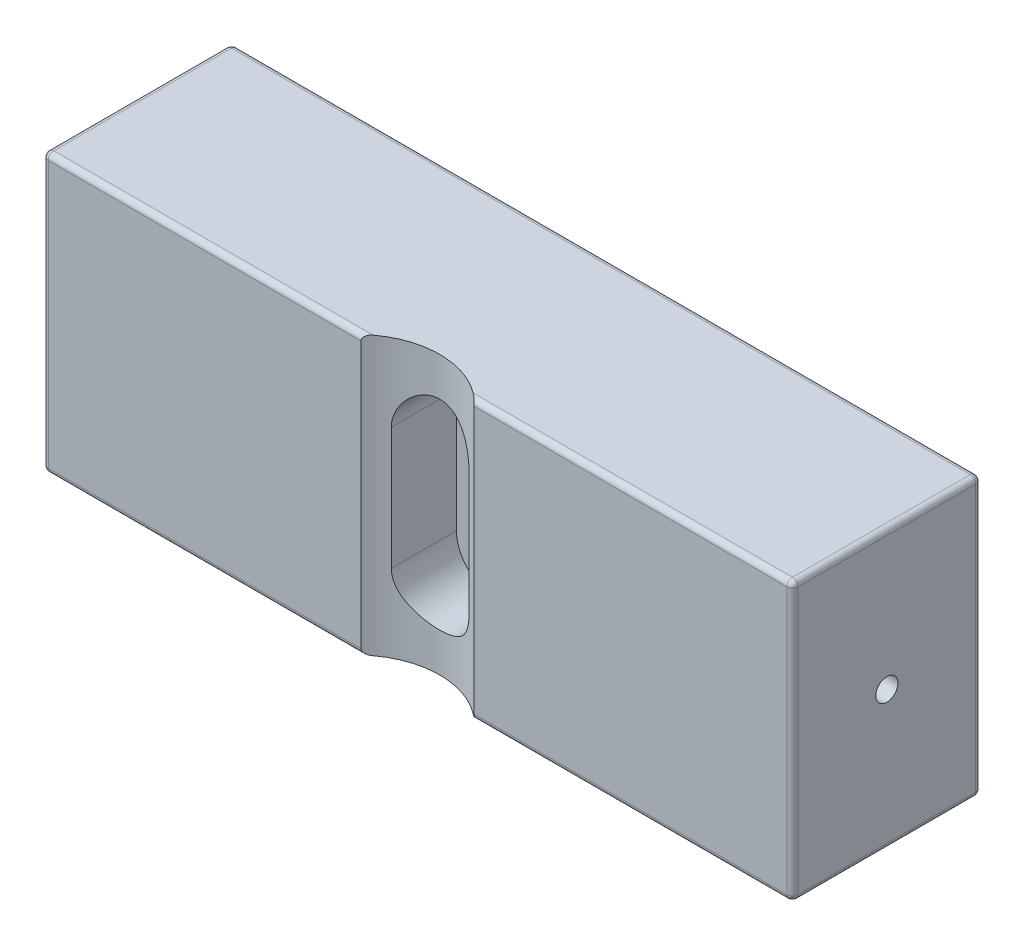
from build123d import *

# Parameters (mm, degrees)
CROQUIS1_W              = 135
CROQUIS1_H              = 50
SALIENTE_EXTRUIR1_DEPTH = 34
CROQUIS2_R              = 15
CORTAR_EXTRUIR1_DEPTH   = 50
CORTAR_EXTRUIR2_DEPTH   = 14
CROQUIS5_R              = 2
CORTAR_EXTRUIR4_DEPTH   = 10
REDONDEO1_R             = 1


with BuildPart() as part:
    # Croquis1 → Saliente-Extruir1 (new body)
    with BuildSketch(Plane.XY):
        Rectangle(CROQUIS1_W, CROQUIS1_H)
    extrude(amount=SALIENTE_EXTRUIR1_DEPTH)

    # Croquis2 → Cortar-Extruir1 (cut)
    with BuildSketch(Plane(origin=(0, 25, 0), x_dir=(1, 0, 0), z_dir=(0, 1, 0))):
        with Locations((0, -45)):
            Circle(CROQUIS2_R)
    extrude(amount=-CORTAR_EXTRUIR1_DEPTH, mode=Mode.SUBTRACT)

    # Croquis3 → Cortar-Extruir2 (cut)
    with BuildSketch(Plane.XY.offset(34)):
        with BuildLine():
            Line((-7, -11), (-7, 11))
            ThreePointArc((-7, 11), (0, 18), (7, 11))
            Line((7, 11), (7, -11))
            ThreePointArc((7, -11), (0, -18), (-7, -11))
        make_face()
    extrude(amount=-CORTAR_EXTRUIR2_DEPTH, mode=Mode.SUBTRACT)

    # Croquis5 → Cortar-Extruir4 (cut)
    with BuildSketch(Plane.ZY.offset(67.5)):
        with Locations((17, 0)):
            Circle(CROQUIS5_R)
    cortar_extruir4 = extrude(amount=-CORTAR_EXTRUIR4_DEPTH, mode=Mode.SUBTRACT)

    # Simetr_a1: Cortar-Extruir4 across plane
    add(cortar_extruir4.mirror(Plane(origin=(0, 0, 0), x_dir=(0, 0, 1), z_dir=(1, 0, 0))), mode=Mode.SUBTRACT)

    # Redondeo1
    redondeo1_edges = [part.edges().sort_by_distance(p)[0] for p in [
        (-67.5, 0, 34),
        (-38.849019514, -25, 34),
        (-38.849019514, 25, 34),
        (38.849019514, -25, 34),
        (67.5, 0, 34),
        (0, -25, 0),
        (-67.5, 0, 0),
        (0, 25, 0),
        (67.5, 0, 0),
        (38.849019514, 25, 34),
        (67.5, -25, 17),
        (-67.5, -25, 17),
        (-67.5, 25, 17),
        (67.5, 25, 17),
    ]]
    fillet(redondeo1_edges, radius=REDONDEO1_R)


solid = part.part
